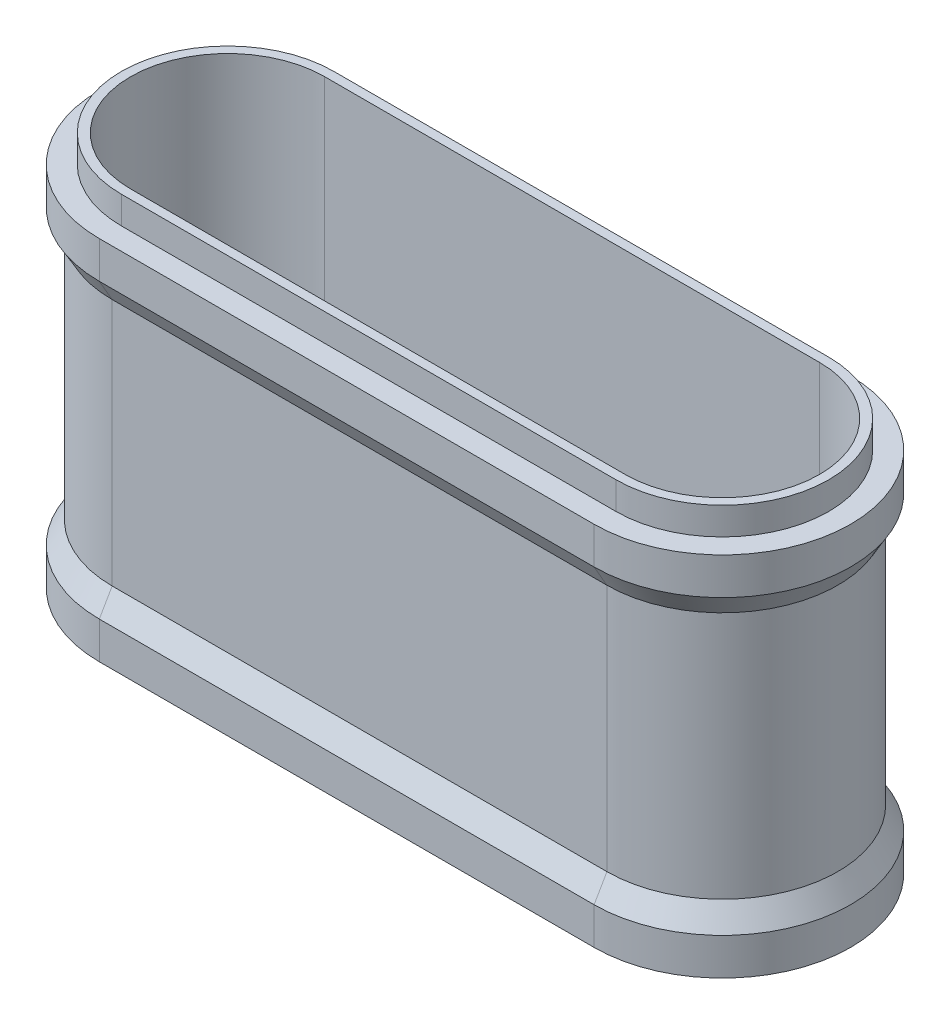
ISO-10303-21;
HEADER;
FILE_DESCRIPTION(('STEP AP214'),'2;1');
FILE_NAME('part.step','',(''),(''),'','','');
FILE_SCHEMA(('AUTOMOTIVE_DESIGN { 1 0 10303 214 1 1 1 1 }'));
ENDSEC;
DATA;
#1=APPLICATION_CONTEXT('core data for automotive mechanical design processes');
#2=APPLICATION_PROTOCOL_DEFINITION('international standard','automotive_design',2000,#1);
#3=PRODUCT_CONTEXT('',#1,'mechanical');
#4=PRODUCT('Part','Part','',(#3));
#5=PRODUCT_RELATED_PRODUCT_CATEGORY('part','',(#4));
#6=PRODUCT_DEFINITION_FORMATION('','',#4);
#7=PRODUCT_DEFINITION_CONTEXT('part definition',#1,'design');
#8=PRODUCT_DEFINITION('design','',#6,#7);
#9=PRODUCT_DEFINITION_SHAPE('','',#8);
#10=(LENGTH_UNIT() NAMED_UNIT(*) SI_UNIT(.MILLI.,.METRE.));
#11=(NAMED_UNIT(*) PLANE_ANGLE_UNIT() SI_UNIT($,.RADIAN.));
#12=(NAMED_UNIT(*) SI_UNIT($,.STERADIAN.) SOLID_ANGLE_UNIT());
#13=UNCERTAINTY_MEASURE_WITH_UNIT(LENGTH_MEASURE(1.E-05),#10,'distance_accuracy_value','');
#14=(GEOMETRIC_REPRESENTATION_CONTEXT(3) GLOBAL_UNCERTAINTY_ASSIGNED_CONTEXT((#13)) GLOBAL_UNIT_ASSIGNED_CONTEXT((#10,
#11,#12)) REPRESENTATION_CONTEXT('',''));
#15=CARTESIAN_POINT('',(0.,0.,0.));
#16=DIRECTION('',(0.,0.,1.));
#17=DIRECTION('',(1.,0.,0.));
#18=AXIS2_PLACEMENT_3D('',#15,#16,#17);
#19=CARTESIAN_POINT('',(-13.5,10.,0.));
#20=DIRECTION('',(0.,1.,0.));
#21=DIRECTION('',(0.,0.,1.));
#22=AXIS2_PLACEMENT_3D('',#19,#20,#21);
#23=PLANE('',#22);
#24=CARTESIAN_POINT('',(13.5,10.,0.));
#25=DIRECTION('',(0.,1.,0.));
#26=DIRECTION('',(0.,0.,1.));
#27=AXIS2_PLACEMENT_3D('',#24,#25,#26);
#28=CIRCLE('',#27,7.);
#29=CARTESIAN_POINT('',(13.5,10.,6.99999999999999));
#30=VERTEX_POINT('',#29);
#31=CARTESIAN_POINT('',(13.5,10.,-7.00000000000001));
#32=VERTEX_POINT('',#31);
#33=EDGE_CURVE('E279',#30,#32,#28,.T.);
#34=ORIENTED_EDGE('',*,*,#33,.T.);
#35=DIRECTION('',(-1.,0.,0.));
#36=VECTOR('',#35,1.);
#37=CARTESIAN_POINT('',(13.5,10.,-7.00000000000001));
#38=LINE('',#37,#36);
#39=CARTESIAN_POINT('',(-13.5,10.,-7.));
#40=VERTEX_POINT('',#39);
#41=EDGE_CURVE('E294',#32,#40,#38,.T.);
#42=ORIENTED_EDGE('',*,*,#41,.T.);
#43=CARTESIAN_POINT('',(-13.5,10.,0.));
#44=DIRECTION('',(0.,1.,0.));
#45=DIRECTION('',(0.,0.,1.));
#46=AXIS2_PLACEMENT_3D('',#43,#44,#45);
#47=CIRCLE('',#46,7.);
#48=CARTESIAN_POINT('',(-13.5,10.,7.));
#49=VERTEX_POINT('',#48);
#50=EDGE_CURVE('E298',#40,#49,#47,.T.);
#51=ORIENTED_EDGE('',*,*,#50,.T.);
#52=DIRECTION('',(1.,0.,0.));
#53=VECTOR('',#52,1.);
#54=CARTESIAN_POINT('',(13.5,10.,6.99999999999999));
#55=LINE('',#54,#53);
#56=EDGE_CURVE('E302',#49,#30,#55,.T.);
#57=ORIENTED_EDGE('',*,*,#56,.T.);
#58=EDGE_LOOP('',(#34,#42,#51,#57));
#59=FACE_BOUND('',#58,.T.);
#60=DIRECTION('',(1.,0.,0.));
#61=VECTOR('',#60,1.);
#62=CARTESIAN_POINT('',(-13.5,10.,5.8));
#63=LINE('',#62,#61);
#64=CARTESIAN_POINT('',(-13.5,10.,5.8));
#65=VERTEX_POINT('',#64);
#66=CARTESIAN_POINT('',(13.5,10.,5.8));
#67=VERTEX_POINT('',#66);
#68=EDGE_CURVE('E239',#65,#67,#63,.T.);
#69=ORIENTED_EDGE('',*,*,#68,.F.);
#70=CARTESIAN_POINT('',(-13.5,10.,0.));
#71=DIRECTION('',(0.,1.,0.));
#72=DIRECTION('',(0.,0.,1.));
#73=AXIS2_PLACEMENT_3D('',#70,#71,#72);
#74=CIRCLE('',#73,5.8);
#75=CARTESIAN_POINT('',(-13.5,10.,-5.8));
#76=VERTEX_POINT('',#75);
#77=EDGE_CURVE('E220',#76,#65,#74,.T.);
#78=ORIENTED_EDGE('',*,*,#77,.F.);
#79=DIRECTION('',(-1.,0.,0.));
#80=VECTOR('',#79,1.);
#81=CARTESIAN_POINT('',(13.5,10.,-5.8));
#82=LINE('',#81,#80);
#83=CARTESIAN_POINT('',(13.5,10.,-5.8));
#84=VERTEX_POINT('',#83);
#85=EDGE_CURVE('E226',#84,#76,#82,.T.);
#86=ORIENTED_EDGE('',*,*,#85,.F.);
#87=CARTESIAN_POINT('',(13.5,10.,0.));
#88=DIRECTION('',(0.,1.,0.));
#89=DIRECTION('',(0.,0.,1.));
#90=AXIS2_PLACEMENT_3D('',#87,#88,#89);
#91=CIRCLE('',#90,5.8);
#92=EDGE_CURVE('E242',#67,#84,#91,.T.);
#93=ORIENTED_EDGE('',*,*,#92,.F.);
#94=EDGE_LOOP('',(#69,#78,#86,#93));
#95=FACE_BOUND('',#94,.T.);
#96=ADVANCED_FACE('F44',(#59,#95),#23,.T.);
#97=CARTESIAN_POINT('',(-13.5,-10.,0.));
#98=DIRECTION('',(0.,1.,0.));
#99=DIRECTION('',(0.,0.,1.));
#100=AXIS2_PLACEMENT_3D('',#97,#98,#99);
#101=CYLINDRICAL_SURFACE('',#100,6.3);
#102=DIRECTION('',(0.,1.,0.));
#103=VECTOR('',#102,1.);
#104=CARTESIAN_POINT('',(-13.5,-10.,-6.3));
#105=LINE('',#104,#103);
#106=CARTESIAN_POINT('',(-13.5,-6.76794919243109,-6.3));
#107=VERTEX_POINT('',#106);
#108=CARTESIAN_POINT('',(-13.5,6.76794919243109,-6.3));
#109=VERTEX_POINT('',#108);
#110=EDGE_CURVE('E337',#107,#109,#105,.T.);
#111=ORIENTED_EDGE('',*,*,#110,.F.);
#112=CARTESIAN_POINT('',(-13.5,-6.76794919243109,0.));
#113=DIRECTION('',(0.,-1.,0.));
#114=DIRECTION('',(0.,0.,-1.));
#115=AXIS2_PLACEMENT_3D('',#112,#113,#114);
#116=CIRCLE('',#115,6.3);
#117=CARTESIAN_POINT('',(-13.5,-6.76794919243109,6.3));
#118=VERTEX_POINT('',#117);
#119=EDGE_CURVE('E375',#107,#118,#116,.F.);
#120=ORIENTED_EDGE('',*,*,#119,.T.);
#121=DIRECTION('',(0.,1.,0.));
#122=VECTOR('',#121,1.);
#123=CARTESIAN_POINT('',(-13.5,-10.,6.3));
#124=LINE('',#123,#122);
#125=CARTESIAN_POINT('',(-13.5,6.76794919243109,6.3));
#126=VERTEX_POINT('',#125);
#127=EDGE_CURVE('E331',#118,#126,#124,.T.);
#128=ORIENTED_EDGE('',*,*,#127,.T.);
#129=CARTESIAN_POINT('',(-13.5,6.76794919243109,0.));
#130=DIRECTION('',(0.,1.,0.));
#131=DIRECTION('',(0.,0.,1.));
#132=AXIS2_PLACEMENT_3D('',#129,#130,#131);
#133=CIRCLE('',#132,6.3);
#134=EDGE_CURVE('E372',#126,#109,#133,.F.);
#135=ORIENTED_EDGE('',*,*,#134,.T.);
#136=EDGE_LOOP('',(#111,#120,#128,#135));
#137=FACE_BOUND('',#136,.T.);
#138=ADVANCED_FACE('F476',(#137),#101,.T.);
#139=CARTESIAN_POINT('',(-13.5,-10.,-6.3));
#140=DIRECTION('',(0.,0.,-1.));
#141=DIRECTION('',(-1.,0.,0.));
#142=AXIS2_PLACEMENT_3D('',#139,#140,#141);
#143=PLANE('',#142);
#144=DIRECTION('',(0.,1.,0.));
#145=VECTOR('',#144,1.);
#146=CARTESIAN_POINT('',(13.5,-10.,-6.3));
#147=LINE('',#146,#145);
#148=CARTESIAN_POINT('',(13.5,-6.76794919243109,-6.3));
#149=VERTEX_POINT('',#148);
#150=CARTESIAN_POINT('',(13.5,6.76794919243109,-6.3));
#151=VERTEX_POINT('',#150);
#152=EDGE_CURVE('E342',#149,#151,#147,.T.);
#153=ORIENTED_EDGE('',*,*,#152,.F.);
#154=DIRECTION('',(-1.,0.,0.));
#155=VECTOR('',#154,1.);
#156=CARTESIAN_POINT('',(-13.5,-6.76794919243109,-6.3));
#157=LINE('',#156,#155);
#158=EDGE_CURVE('E363',#149,#107,#157,.T.);
#159=ORIENTED_EDGE('',*,*,#158,.T.);
#160=ORIENTED_EDGE('',*,*,#110,.T.);
#161=DIRECTION('',(1.,0.,0.));
#162=VECTOR('',#161,1.);
#163=CARTESIAN_POINT('',(-13.5,6.76794919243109,-6.3));
#164=LINE('',#163,#162);
#165=EDGE_CURVE('E359',#109,#151,#164,.T.);
#166=ORIENTED_EDGE('',*,*,#165,.T.);
#167=EDGE_LOOP('',(#153,#159,#160,#166));
#168=FACE_BOUND('',#167,.T.);
#169=ADVANCED_FACE('F457',(#168),#143,.T.);
#170=CARTESIAN_POINT('',(13.5,-10.,0.));
#171=DIRECTION('',(0.,1.,0.));
#172=DIRECTION('',(0.,0.,1.));
#173=AXIS2_PLACEMENT_3D('',#170,#171,#172);
#174=CYLINDRICAL_SURFACE('',#173,6.3);
#175=DIRECTION('',(0.,1.,0.));
#176=VECTOR('',#175,1.);
#177=CARTESIAN_POINT('',(13.5,-10.,6.3));
#178=LINE('',#177,#176);
#179=CARTESIAN_POINT('',(13.5,-6.76794919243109,6.3));
#180=VERTEX_POINT('',#179);
#181=CARTESIAN_POINT('',(13.5,6.76794919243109,6.3));
#182=VERTEX_POINT('',#181);
#183=EDGE_CURVE('E346',#180,#182,#178,.T.);
#184=ORIENTED_EDGE('',*,*,#183,.F.);
#185=CARTESIAN_POINT('',(13.5,-6.76794919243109,0.));
#186=DIRECTION('',(0.,-1.,0.));
#187=DIRECTION('',(0.,0.,-1.));
#188=AXIS2_PLACEMENT_3D('',#185,#186,#187);
#189=CIRCLE('',#188,6.3);
#190=EDGE_CURVE('E355',#180,#149,#189,.F.);
#191=ORIENTED_EDGE('',*,*,#190,.T.);
#192=ORIENTED_EDGE('',*,*,#152,.T.);
#193=CARTESIAN_POINT('',(13.5,6.76794919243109,0.));
#194=DIRECTION('',(0.,1.,0.));
#195=DIRECTION('',(0.,0.,1.));
#196=AXIS2_PLACEMENT_3D('',#193,#194,#195);
#197=CIRCLE('',#196,6.3);
#198=EDGE_CURVE('E341',#151,#182,#197,.F.);
#199=ORIENTED_EDGE('',*,*,#198,.T.);
#200=EDGE_LOOP('',(#184,#191,#192,#199));
#201=FACE_BOUND('',#200,.T.);
#202=ADVANCED_FACE('F461',(#201),#174,.T.);
#203=CARTESIAN_POINT('',(-13.5,-10.,6.3));
#204=DIRECTION('',(0.,0.,1.));
#205=DIRECTION('',(1.,0.,0.));
#206=AXIS2_PLACEMENT_3D('',#203,#204,#205);
#207=PLANE('',#206);
#208=ORIENTED_EDGE('',*,*,#127,.F.);
#209=DIRECTION('',(1.,0.,0.));
#210=VECTOR('',#209,1.);
#211=CARTESIAN_POINT('',(-13.5,-6.76794919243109,6.3));
#212=LINE('',#211,#210);
#213=EDGE_CURVE('E369',#118,#180,#212,.T.);
#214=ORIENTED_EDGE('',*,*,#213,.T.);
#215=ORIENTED_EDGE('',*,*,#183,.T.);
#216=DIRECTION('',(-1.,0.,0.));
#217=VECTOR('',#216,1.);
#218=CARTESIAN_POINT('',(-13.5,6.76794919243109,6.3));
#219=LINE('',#218,#217);
#220=EDGE_CURVE('E366',#182,#126,#219,.T.);
#221=ORIENTED_EDGE('',*,*,#220,.T.);
#222=EDGE_LOOP('',(#208,#214,#215,#221));
#223=FACE_BOUND('',#222,.T.);
#224=ADVANCED_FACE('F486',(#223),#207,.T.);
#225=CARTESIAN_POINT('',(-13.5,-10.,0.));
#226=DIRECTION('',(0.,1.,0.));
#227=DIRECTION('',(0.,0.,1.));
#228=AXIS2_PLACEMENT_3D('',#225,#226,#227);
#229=PLANE('',#228);
#230=DIRECTION('',(-1.,0.,0.));
#231=VECTOR('',#230,1.);
#232=CARTESIAN_POINT('',(-13.5,-10.,-5.3));
#233=LINE('',#232,#231);
#234=CARTESIAN_POINT('',(13.5,-10.,-5.30000000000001));
#235=VERTEX_POINT('',#234);
#236=CARTESIAN_POINT('',(-13.5,-10.,-5.3));
#237=VERTEX_POINT('',#236);
#238=EDGE_CURVE('E192',#235,#237,#233,.T.);
#239=ORIENTED_EDGE('',*,*,#238,.T.);
#240=CARTESIAN_POINT('',(-13.5,-10.,0.));
#241=DIRECTION('',(0.,1.,0.));
#242=DIRECTION('',(0.,0.,1.));
#243=AXIS2_PLACEMENT_3D('',#240,#241,#242);
#244=CIRCLE('',#243,5.3);
#245=CARTESIAN_POINT('',(-13.5,-10.,5.3));
#246=VERTEX_POINT('',#245);
#247=EDGE_CURVE('E309',#237,#246,#244,.T.);
#248=ORIENTED_EDGE('',*,*,#247,.T.);
#249=DIRECTION('',(1.,0.,0.));
#250=VECTOR('',#249,1.);
#251=CARTESIAN_POINT('',(-13.5,-10.,5.3));
#252=LINE('',#251,#250);
#253=CARTESIAN_POINT('',(13.5,-10.,5.29999999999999));
#254=VERTEX_POINT('',#253);
#255=EDGE_CURVE('E320',#246,#254,#252,.T.);
#256=ORIENTED_EDGE('',*,*,#255,.T.);
#257=CARTESIAN_POINT('',(13.5,-10.,0.));
#258=DIRECTION('',(0.,1.,0.));
#259=DIRECTION('',(0.,0.,1.));
#260=AXIS2_PLACEMENT_3D('',#257,#258,#259);
#261=CIRCLE('',#260,5.3);
#262=EDGE_CURVE('E324',#254,#235,#261,.T.);
#263=ORIENTED_EDGE('',*,*,#262,.T.);
#264=EDGE_LOOP('',(#239,#248,#256,#263));
#265=FACE_BOUND('',#264,.T.);
#266=CARTESIAN_POINT('',(13.5,-10.,0.));
#267=DIRECTION('',(0.,1.,0.));
#268=DIRECTION('',(0.,0.,1.));
#269=AXIS2_PLACEMENT_3D('',#266,#267,#268);
#270=CIRCLE('',#269,7.);
#271=CARTESIAN_POINT('',(13.5,-10.,6.99999999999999));
#272=VERTEX_POINT('',#271);
#273=CARTESIAN_POINT('',(13.5,-10.,-7.00000000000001));
#274=VERTEX_POINT('',#273);
#275=EDGE_CURVE('E261',#272,#274,#270,.T.);
#276=ORIENTED_EDGE('',*,*,#275,.F.);
#277=DIRECTION('',(1.,0.,0.));
#278=VECTOR('',#277,1.);
#279=CARTESIAN_POINT('',(13.5,-10.,6.99999999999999));
#280=LINE('',#279,#278);
#281=CARTESIAN_POINT('',(-13.5,-10.,7.));
#282=VERTEX_POINT('',#281);
#283=EDGE_CURVE('E265',#282,#272,#280,.T.);
#284=ORIENTED_EDGE('',*,*,#283,.F.);
#285=CARTESIAN_POINT('',(-13.5,-10.,0.));
#286=DIRECTION('',(0.,1.,0.));
#287=DIRECTION('',(0.,0.,1.));
#288=AXIS2_PLACEMENT_3D('',#285,#286,#287);
#289=CIRCLE('',#288,7.);
#290=CARTESIAN_POINT('',(-13.5,-10.,-7.));
#291=VERTEX_POINT('',#290);
#292=EDGE_CURVE('E268',#291,#282,#289,.T.);
#293=ORIENTED_EDGE('',*,*,#292,.F.);
#294=DIRECTION('',(-1.,0.,0.));
#295=VECTOR('',#294,1.);
#296=CARTESIAN_POINT('',(13.5,-10.,-7.00000000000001));
#297=LINE('',#296,#295);
#298=EDGE_CURVE('E271',#274,#291,#297,.T.);
#299=ORIENTED_EDGE('',*,*,#298,.F.);
#300=EDGE_LOOP('',(#276,#284,#293,#299));
#301=FACE_BOUND('',#300,.T.);
#302=ADVANCED_FACE('F488',(#265,#301),#229,.F.);
#303=CARTESIAN_POINT('',(-13.5,-10.,0.));
#304=DIRECTION('',(0.,1.,0.));
#305=DIRECTION('',(0.,0.,1.));
#306=AXIS2_PLACEMENT_3D('',#303,#304,#305);
#307=CYLINDRICAL_SURFACE('',#306,5.3);
#308=DIRECTION('',(0.,1.,0.));
#309=VECTOR('',#308,1.);
#310=CARTESIAN_POINT('',(-13.5,-10.,-5.3));
#311=LINE('',#310,#309);
#312=CARTESIAN_POINT('',(-13.5,11.5,-5.3));
#313=VERTEX_POINT('',#312);
#314=EDGE_CURVE('E196',#237,#313,#311,.T.);
#315=ORIENTED_EDGE('',*,*,#314,.T.);
#316=CARTESIAN_POINT('',(-13.5,11.5,0.));
#317=DIRECTION('',(0.,1.,0.));
#318=DIRECTION('',(0.,0.,1.));
#319=AXIS2_PLACEMENT_3D('',#316,#317,#318);
#320=CIRCLE('',#319,5.3);
#321=CARTESIAN_POINT('',(-13.5,11.5,5.3));
#322=VERTEX_POINT('',#321);
#323=EDGE_CURVE('E211',#313,#322,#320,.T.);
#324=ORIENTED_EDGE('',*,*,#323,.T.);
#325=DIRECTION('',(0.,1.,0.));
#326=VECTOR('',#325,1.);
#327=CARTESIAN_POINT('',(-13.5,-10.,5.3));
#328=LINE('',#327,#326);
#329=EDGE_CURVE('E329',#246,#322,#328,.T.);
#330=ORIENTED_EDGE('',*,*,#329,.F.);
#331=ORIENTED_EDGE('',*,*,#247,.F.);
#332=EDGE_LOOP('',(#315,#324,#330,#331));
#333=FACE_BOUND('',#332,.T.);
#334=ADVANCED_FACE('F494',(#333),#307,.F.);
#335=CARTESIAN_POINT('',(-13.5,-10.,-5.3));
#336=DIRECTION('',(0.,0.,-1.));
#337=DIRECTION('',(-1.,0.,0.));
#338=AXIS2_PLACEMENT_3D('',#335,#336,#337);
#339=PLANE('',#338);
#340=DIRECTION('',(0.,1.,0.));
#341=VECTOR('',#340,1.);
#342=CARTESIAN_POINT('',(13.5,-10.,-5.30000000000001));
#343=LINE('',#342,#341);
#344=CARTESIAN_POINT('',(13.5,11.5,-5.30000000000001));
#345=VERTEX_POINT('',#344);
#346=EDGE_CURVE('E185',#235,#345,#343,.T.);
#347=ORIENTED_EDGE('',*,*,#346,.T.);
#348=DIRECTION('',(-1.,0.,0.));
#349=VECTOR('',#348,1.);
#350=CARTESIAN_POINT('',(13.5,11.5,-5.30000000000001));
#351=LINE('',#350,#349);
#352=EDGE_CURVE('E189',#345,#313,#351,.T.);
#353=ORIENTED_EDGE('',*,*,#352,.T.);
#354=ORIENTED_EDGE('',*,*,#314,.F.);
#355=ORIENTED_EDGE('',*,*,#238,.F.);
#356=EDGE_LOOP('',(#347,#353,#354,#355));
#357=FACE_BOUND('',#356,.T.);
#358=ADVANCED_FACE('F187',(#357),#339,.F.);
#359=CARTESIAN_POINT('',(13.5,-10.,0.));
#360=DIRECTION('',(0.,1.,0.));
#361=DIRECTION('',(0.,0.,1.));
#362=AXIS2_PLACEMENT_3D('',#359,#360,#361);
#363=CYLINDRICAL_SURFACE('',#362,5.3);
#364=DIRECTION('',(0.,1.,0.));
#365=VECTOR('',#364,1.);
#366=CARTESIAN_POINT('',(13.5,-10.,5.3));
#367=LINE('',#366,#365);
#368=CARTESIAN_POINT('',(13.5,11.5,5.3));
#369=VERTEX_POINT('',#368);
#370=EDGE_CURVE('E197',#254,#369,#367,.T.);
#371=ORIENTED_EDGE('',*,*,#370,.T.);
#372=CARTESIAN_POINT('',(13.5,11.5,0.));
#373=DIRECTION('',(0.,1.,0.));
#374=DIRECTION('',(0.,0.,1.));
#375=AXIS2_PLACEMENT_3D('',#372,#373,#374);
#376=CIRCLE('',#375,5.3);
#377=EDGE_CURVE('E200',#369,#345,#376,.T.);
#378=ORIENTED_EDGE('',*,*,#377,.T.);
#379=ORIENTED_EDGE('',*,*,#346,.F.);
#380=ORIENTED_EDGE('',*,*,#262,.F.);
#381=EDGE_LOOP('',(#371,#378,#379,#380));
#382=FACE_BOUND('',#381,.T.);
#383=ADVANCED_FACE('F201',(#382),#363,.F.);
#384=CARTESIAN_POINT('',(-13.5,-10.,5.3));
#385=DIRECTION('',(0.,0.,1.));
#386=DIRECTION('',(1.,0.,0.));
#387=AXIS2_PLACEMENT_3D('',#384,#385,#386);
#388=PLANE('',#387);
#389=ORIENTED_EDGE('',*,*,#329,.T.);
#390=DIRECTION('',(1.,0.,0.));
#391=VECTOR('',#390,1.);
#392=CARTESIAN_POINT('',(-13.5,11.5,5.3));
#393=LINE('',#392,#391);
#394=EDGE_CURVE('E215',#322,#369,#393,.T.);
#395=ORIENTED_EDGE('',*,*,#394,.T.);
#396=ORIENTED_EDGE('',*,*,#370,.F.);
#397=ORIENTED_EDGE('',*,*,#255,.F.);
#398=EDGE_LOOP('',(#389,#395,#396,#397));
#399=FACE_BOUND('',#398,.T.);
#400=ADVANCED_FACE('F511',(#399),#388,.F.);
#401=CARTESIAN_POINT('',(13.5,8.5,0.));
#402=DIRECTION('',(0.,1.,0.));
#403=DIRECTION('',(0.,0.,1.));
#404=AXIS2_PLACEMENT_3D('',#401,#402,#403);
#405=CYLINDRICAL_SURFACE('',#404,7.);
#406=ORIENTED_EDGE('',*,*,#33,.F.);
#407=DIRECTION('',(0.,1.,0.));
#408=VECTOR('',#407,1.);
#409=CARTESIAN_POINT('',(13.5,8.5,6.99999999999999));
#410=LINE('',#409,#408);
#411=CARTESIAN_POINT('',(13.5,7.98038475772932,7.));
#412=VERTEX_POINT('',#411);
#413=EDGE_CURVE('E63',#412,#30,#410,.T.);
#414=ORIENTED_EDGE('',*,*,#413,.F.);
#415=CARTESIAN_POINT('',(13.5,7.98038475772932,0.));
#416=DIRECTION('',(0.,1.,0.));
#417=DIRECTION('',(0.,0.,1.));
#418=AXIS2_PLACEMENT_3D('',#415,#416,#417);
#419=CIRCLE('',#418,7.);
#420=CARTESIAN_POINT('',(13.5,7.98038475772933,-7.00000000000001));
#421=VERTEX_POINT('',#420);
#422=EDGE_CURVE('E398',#412,#421,#419,.T.);
#423=ORIENTED_EDGE('',*,*,#422,.T.);
#424=DIRECTION('',(0.,1.,0.));
#425=VECTOR('',#424,1.);
#426=CARTESIAN_POINT('',(13.5,8.5,-7.00000000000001));
#427=LINE('',#426,#425);
#428=EDGE_CURVE('E306',#421,#32,#427,.T.);
#429=ORIENTED_EDGE('',*,*,#428,.T.);
#430=EDGE_LOOP('',(#406,#414,#423,#429));
#431=FACE_BOUND('',#430,.T.);
#432=ADVANCED_FACE('F442',(#431),#405,.T.);
#433=CARTESIAN_POINT('',(13.5,8.5,6.99999999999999));
#434=DIRECTION('',(0.,0.,1.));
#435=DIRECTION('',(1.,0.,0.));
#436=AXIS2_PLACEMENT_3D('',#433,#434,#435);
#437=PLANE('',#436);
#438=ORIENTED_EDGE('',*,*,#56,.F.);
#439=DIRECTION('',(0.,1.,0.));
#440=VECTOR('',#439,1.);
#441=CARTESIAN_POINT('',(-13.5,8.5,7.));
#442=LINE('',#441,#440);
#443=CARTESIAN_POINT('',(-13.5,7.98038475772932,7.));
#444=VERTEX_POINT('',#443);
#445=EDGE_CURVE('E69',#444,#49,#442,.T.);
#446=ORIENTED_EDGE('',*,*,#445,.F.);
#447=DIRECTION('',(1.,0.,0.));
#448=VECTOR('',#447,1.);
#449=CARTESIAN_POINT('',(-13.5,7.98038475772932,7.));
#450=LINE('',#449,#448);
#451=EDGE_CURVE('E11',#444,#412,#450,.T.);
#452=ORIENTED_EDGE('',*,*,#451,.T.);
#453=ORIENTED_EDGE('',*,*,#413,.T.);
#454=EDGE_LOOP('',(#438,#446,#452,#453));
#455=FACE_BOUND('',#454,.T.);
#456=ADVANCED_FACE('F441',(#455),#437,.T.);
#457=CARTESIAN_POINT('',(-13.5,8.5,0.));
#458=DIRECTION('',(0.,1.,0.));
#459=DIRECTION('',(0.,0.,1.));
#460=AXIS2_PLACEMENT_3D('',#457,#458,#459);
#461=CYLINDRICAL_SURFACE('',#460,7.);
#462=ORIENTED_EDGE('',*,*,#50,.F.);
#463=DIRECTION('',(0.,1.,0.));
#464=VECTOR('',#463,1.);
#465=CARTESIAN_POINT('',(-13.5,8.5,-7.));
#466=LINE('',#465,#464);
#467=CARTESIAN_POINT('',(-13.5,7.98038475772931,-7.));
#468=VERTEX_POINT('',#467);
#469=EDGE_CURVE('E312',#468,#40,#466,.T.);
#470=ORIENTED_EDGE('',*,*,#469,.F.);
#471=CARTESIAN_POINT('',(-13.5,7.98038475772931,0.));
#472=DIRECTION('',(0.,1.,0.));
#473=DIRECTION('',(0.,0.,1.));
#474=AXIS2_PLACEMENT_3D('',#471,#472,#473);
#475=CIRCLE('',#474,7.);
#476=EDGE_CURVE('E55',#468,#444,#475,.T.);
#477=ORIENTED_EDGE('',*,*,#476,.T.);
#478=ORIENTED_EDGE('',*,*,#445,.T.);
#479=EDGE_LOOP('',(#462,#470,#477,#478));
#480=FACE_BOUND('',#479,.T.);
#481=ADVANCED_FACE('F448',(#480),#461,.T.);
#482=CARTESIAN_POINT('',(13.5,8.5,-7.00000000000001));
#483=DIRECTION('',(0.,0.,-1.));
#484=DIRECTION('',(-1.,0.,0.));
#485=AXIS2_PLACEMENT_3D('',#482,#483,#484);
#486=PLANE('',#485);
#487=ORIENTED_EDGE('',*,*,#428,.F.);
#488=DIRECTION('',(-1.,0.,0.));
#489=VECTOR('',#488,1.);
#490=CARTESIAN_POINT('',(-13.5,7.98038475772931,-7.));
#491=LINE('',#490,#489);
#492=EDGE_CURVE('E394',#421,#468,#491,.T.);
#493=ORIENTED_EDGE('',*,*,#492,.T.);
#494=ORIENTED_EDGE('',*,*,#469,.T.);
#495=ORIENTED_EDGE('',*,*,#41,.F.);
#496=EDGE_LOOP('',(#487,#493,#494,#495));
#497=FACE_BOUND('',#496,.T.);
#498=ADVANCED_FACE('F561',(#497),#486,.T.);
#499=CARTESIAN_POINT('',(13.5,-8.5,0.));
#500=DIRECTION('',(0.,-1.,0.));
#501=DIRECTION('',(0.,0.,-1.));
#502=AXIS2_PLACEMENT_3D('',#499,#500,#501);
#503=CYLINDRICAL_SURFACE('',#502,7.);
#504=ORIENTED_EDGE('',*,*,#275,.T.);
#505=DIRECTION('',(0.,-1.,0.));
#506=VECTOR('',#505,1.);
#507=CARTESIAN_POINT('',(13.5,-8.5,-7.00000000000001));
#508=LINE('',#507,#506);
#509=CARTESIAN_POINT('',(13.5,-7.98038475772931,-7.));
#510=VERTEX_POINT('',#509);
#511=EDGE_CURVE('E275',#510,#274,#508,.T.);
#512=ORIENTED_EDGE('',*,*,#511,.F.);
#513=CARTESIAN_POINT('',(13.5,-7.98038475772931,0.));
#514=DIRECTION('',(0.,-1.,0.));
#515=DIRECTION('',(0.,0.,-1.));
#516=AXIS2_PLACEMENT_3D('',#513,#514,#515);
#517=CIRCLE('',#516,7.);
#518=CARTESIAN_POINT('',(13.5,-7.98038475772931,6.99999999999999));
#519=VERTEX_POINT('',#518);
#520=EDGE_CURVE('E378',#510,#519,#517,.T.);
#521=ORIENTED_EDGE('',*,*,#520,.T.);
#522=DIRECTION('',(0.,-1.,0.));
#523=VECTOR('',#522,1.);
#524=CARTESIAN_POINT('',(13.5,-8.5,6.99999999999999));
#525=LINE('',#524,#523);
#526=EDGE_CURVE('E274',#519,#272,#525,.T.);
#527=ORIENTED_EDGE('',*,*,#526,.T.);
#528=EDGE_LOOP('',(#504,#512,#521,#527));
#529=FACE_BOUND('',#528,.T.);
#530=ADVANCED_FACE('F570',(#529),#503,.T.);
#531=CARTESIAN_POINT('',(13.5,-8.5,-7.00000000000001));
#532=DIRECTION('',(0.,0.,1.));
#533=DIRECTION('',(1.,0.,0.));
#534=AXIS2_PLACEMENT_3D('',#531,#532,#533);
#535=PLANE('',#534);
#536=ORIENTED_EDGE('',*,*,#298,.T.);
#537=DIRECTION('',(0.,-1.,0.));
#538=VECTOR('',#537,1.);
#539=CARTESIAN_POINT('',(-13.5,-8.5,-7.));
#540=LINE('',#539,#538);
#541=CARTESIAN_POINT('',(-13.5,-7.98038475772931,-7.));
#542=VERTEX_POINT('',#541);
#543=EDGE_CURVE('E280',#542,#291,#540,.T.);
#544=ORIENTED_EDGE('',*,*,#543,.F.);
#545=DIRECTION('',(1.,0.,0.));
#546=VECTOR('',#545,1.);
#547=CARTESIAN_POINT('',(13.5,-7.98038475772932,-7.00000000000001));
#548=LINE('',#547,#546);
#549=EDGE_CURVE('E382',#542,#510,#548,.T.);
#550=ORIENTED_EDGE('',*,*,#549,.T.);
#551=ORIENTED_EDGE('',*,*,#511,.T.);
#552=EDGE_LOOP('',(#536,#544,#550,#551));
#553=FACE_BOUND('',#552,.T.);
#554=ADVANCED_FACE('F579',(#553),#535,.F.);
#555=CARTESIAN_POINT('',(-13.5,-8.5,0.));
#556=DIRECTION('',(0.,-1.,0.));
#557=DIRECTION('',(0.,0.,-1.));
#558=AXIS2_PLACEMENT_3D('',#555,#556,#557);
#559=CYLINDRICAL_SURFACE('',#558,7.);
#560=ORIENTED_EDGE('',*,*,#292,.T.);
#561=DIRECTION('',(0.,-1.,0.));
#562=VECTOR('',#561,1.);
#563=CARTESIAN_POINT('',(-13.5,-8.5,7.));
#564=LINE('',#563,#562);
#565=CARTESIAN_POINT('',(-13.5,-7.98038475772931,7.));
#566=VERTEX_POINT('',#565);
#567=EDGE_CURVE('E284',#566,#282,#564,.T.);
#568=ORIENTED_EDGE('',*,*,#567,.F.);
#569=CARTESIAN_POINT('',(-13.5,-7.98038475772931,0.));
#570=DIRECTION('',(0.,-1.,0.));
#571=DIRECTION('',(0.,0.,-1.));
#572=AXIS2_PLACEMENT_3D('',#569,#570,#571);
#573=CIRCLE('',#572,7.);
#574=EDGE_CURVE('E390',#566,#542,#573,.T.);
#575=ORIENTED_EDGE('',*,*,#574,.T.);
#576=ORIENTED_EDGE('',*,*,#543,.T.);
#577=EDGE_LOOP('',(#560,#568,#575,#576));
#578=FACE_BOUND('',#577,.T.);
#579=ADVANCED_FACE('F591',(#578),#559,.T.);
#580=CARTESIAN_POINT('',(13.5,-8.5,6.99999999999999));
#581=DIRECTION('',(0.,0.,-1.));
#582=DIRECTION('',(-1.,0.,0.));
#583=AXIS2_PLACEMENT_3D('',#580,#581,#582);
#584=PLANE('',#583);
#585=ORIENTED_EDGE('',*,*,#283,.T.);
#586=ORIENTED_EDGE('',*,*,#526,.F.);
#587=DIRECTION('',(-1.,0.,0.));
#588=VECTOR('',#587,1.);
#589=CARTESIAN_POINT('',(13.5,-7.98038475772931,6.99999999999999));
#590=LINE('',#589,#588);
#591=EDGE_CURVE('E386',#519,#566,#590,.T.);
#592=ORIENTED_EDGE('',*,*,#591,.T.);
#593=ORIENTED_EDGE('',*,*,#567,.T.);
#594=EDGE_LOOP('',(#585,#586,#592,#593));
#595=FACE_BOUND('',#594,.T.);
#596=ADVANCED_FACE('F602',(#595),#584,.F.);
#597=CARTESIAN_POINT('',(-13.5,11.5,0.));
#598=DIRECTION('',(0.,1.,0.));
#599=DIRECTION('',(0.,0.,1.));
#600=AXIS2_PLACEMENT_3D('',#597,#598,#599);
#601=PLANE('',#600);
#602=CARTESIAN_POINT('',(-13.5,11.5,0.));
#603=DIRECTION('',(0.,1.,0.));
#604=DIRECTION('',(0.,0.,1.));
#605=AXIS2_PLACEMENT_3D('',#602,#603,#604);
#606=CIRCLE('',#605,5.8);
#607=CARTESIAN_POINT('',(-13.5,11.5,-5.8));
#608=VERTEX_POINT('',#607);
#609=CARTESIAN_POINT('',(-13.5,11.5,5.8));
#610=VERTEX_POINT('',#609);
#611=EDGE_CURVE('E221',#608,#610,#606,.T.);
#612=ORIENTED_EDGE('',*,*,#611,.T.);
#613=DIRECTION('',(1.,0.,0.));
#614=VECTOR('',#613,1.);
#615=CARTESIAN_POINT('',(-13.5,11.5,5.8));
#616=LINE('',#615,#614);
#617=CARTESIAN_POINT('',(13.5,11.5,5.8));
#618=VERTEX_POINT('',#617);
#619=EDGE_CURVE('E225',#610,#618,#616,.T.);
#620=ORIENTED_EDGE('',*,*,#619,.T.);
#621=CARTESIAN_POINT('',(13.5,11.5,0.));
#622=DIRECTION('',(0.,1.,0.));
#623=DIRECTION('',(0.,0.,1.));
#624=AXIS2_PLACEMENT_3D('',#621,#622,#623);
#625=CIRCLE('',#624,5.8);
#626=CARTESIAN_POINT('',(13.5,11.5,-5.8));
#627=VERTEX_POINT('',#626);
#628=EDGE_CURVE('E229',#618,#627,#625,.T.);
#629=ORIENTED_EDGE('',*,*,#628,.T.);
#630=DIRECTION('',(-1.,0.,0.));
#631=VECTOR('',#630,1.);
#632=CARTESIAN_POINT('',(13.5,11.5,-5.8));
#633=LINE('',#632,#631);
#634=EDGE_CURVE('E232',#627,#608,#633,.T.);
#635=ORIENTED_EDGE('',*,*,#634,.T.);
#636=EDGE_LOOP('',(#612,#620,#629,#635));
#637=FACE_BOUND('',#636,.T.);
#638=ORIENTED_EDGE('',*,*,#352,.F.);
#639=ORIENTED_EDGE('',*,*,#377,.F.);
#640=ORIENTED_EDGE('',*,*,#394,.F.);
#641=ORIENTED_EDGE('',*,*,#323,.F.);
#642=EDGE_LOOP('',(#638,#639,#640,#641));
#643=FACE_BOUND('',#642,.T.);
#644=ADVANCED_FACE('F209',(#637,#643),#601,.T.);
#645=CARTESIAN_POINT('',(-13.5,11.5,0.));
#646=DIRECTION('',(0.,-1.,0.));
#647=DIRECTION('',(0.,0.,-1.));
#648=AXIS2_PLACEMENT_3D('',#645,#646,#647);
#649=CYLINDRICAL_SURFACE('',#648,5.8);
#650=ORIENTED_EDGE('',*,*,#77,.T.);
#651=DIRECTION('',(0.,-1.,0.));
#652=VECTOR('',#651,1.);
#653=CARTESIAN_POINT('',(-13.5,11.5,5.8));
#654=LINE('',#653,#652);
#655=EDGE_CURVE('E258',#610,#65,#654,.T.);
#656=ORIENTED_EDGE('',*,*,#655,.F.);
#657=ORIENTED_EDGE('',*,*,#611,.F.);
#658=DIRECTION('',(0.,-1.,0.));
#659=VECTOR('',#658,1.);
#660=CARTESIAN_POINT('',(-13.5,11.5,-5.8));
#661=LINE('',#660,#659);
#662=EDGE_CURVE('E235',#608,#76,#661,.T.);
#663=ORIENTED_EDGE('',*,*,#662,.T.);
#664=EDGE_LOOP('',(#650,#656,#657,#663));
#665=FACE_BOUND('',#664,.T.);
#666=ADVANCED_FACE('F725',(#665),#649,.T.);
#667=CARTESIAN_POINT('',(-13.5,11.5,5.8));
#668=DIRECTION('',(0.,0.,-1.));
#669=DIRECTION('',(-1.,0.,0.));
#670=AXIS2_PLACEMENT_3D('',#667,#668,#669);
#671=PLANE('',#670);
#672=ORIENTED_EDGE('',*,*,#68,.T.);
#673=DIRECTION('',(0.,-1.,0.));
#674=VECTOR('',#673,1.);
#675=CARTESIAN_POINT('',(13.5,11.5,5.8));
#676=LINE('',#675,#674);
#677=EDGE_CURVE('E254',#618,#67,#676,.T.);
#678=ORIENTED_EDGE('',*,*,#677,.F.);
#679=ORIENTED_EDGE('',*,*,#619,.F.);
#680=ORIENTED_EDGE('',*,*,#655,.T.);
#681=EDGE_LOOP('',(#672,#678,#679,#680));
#682=FACE_BOUND('',#681,.T.);
#683=ADVANCED_FACE('F715',(#682),#671,.F.);
#684=CARTESIAN_POINT('',(13.5,11.5,0.));
#685=DIRECTION('',(0.,-1.,0.));
#686=DIRECTION('',(0.,0.,-1.));
#687=AXIS2_PLACEMENT_3D('',#684,#685,#686);
#688=CYLINDRICAL_SURFACE('',#687,5.8);
#689=ORIENTED_EDGE('',*,*,#92,.T.);
#690=DIRECTION('',(0.,-1.,0.));
#691=VECTOR('',#690,1.);
#692=CARTESIAN_POINT('',(13.5,11.5,-5.8));
#693=LINE('',#692,#691);
#694=EDGE_CURVE('E251',#627,#84,#693,.T.);
#695=ORIENTED_EDGE('',*,*,#694,.F.);
#696=ORIENTED_EDGE('',*,*,#628,.F.);
#697=ORIENTED_EDGE('',*,*,#677,.T.);
#698=EDGE_LOOP('',(#689,#695,#696,#697));
#699=FACE_BOUND('',#698,.T.);
#700=ADVANCED_FACE('F705',(#699),#688,.T.);
#701=CARTESIAN_POINT('',(13.5,11.5,-5.8));
#702=DIRECTION('',(0.,0.,1.));
#703=DIRECTION('',(1.,0.,0.));
#704=AXIS2_PLACEMENT_3D('',#701,#702,#703);
#705=PLANE('',#704);
#706=ORIENTED_EDGE('',*,*,#85,.T.);
#707=ORIENTED_EDGE('',*,*,#662,.F.);
#708=ORIENTED_EDGE('',*,*,#634,.F.);
#709=ORIENTED_EDGE('',*,*,#694,.T.);
#710=EDGE_LOOP('',(#706,#707,#708,#709));
#711=FACE_BOUND('',#710,.T.);
#712=ADVANCED_FACE('F625',(#711),#705,.F.);
#713=CARTESIAN_POINT('',(-13.5,-6.76794919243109,0.));
#714=DIRECTION('',(0.,-1.,0.));
#715=DIRECTION('',(0.,0.,-1.));
#716=AXIS2_PLACEMENT_3D('',#713,#714,#715);
#717=CONICAL_SURFACE('',#716,6.3,0.523598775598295);
#718=DIRECTION('',(0.,0.866025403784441,0.499999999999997));
#719=VECTOR('',#718,1.);
#720=CARTESIAN_POINT('',(-13.5,-8.5,-7.30000000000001));
#721=LINE('',#720,#719);
#722=EDGE_CURVE('E410',#542,#107,#721,.T.);
#723=ORIENTED_EDGE('',*,*,#722,.F.);
#724=ORIENTED_EDGE('',*,*,#574,.F.);
#725=DIRECTION('',(0.,-0.866025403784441,0.499999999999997));
#726=VECTOR('',#725,1.);
#727=CARTESIAN_POINT('',(-13.5,-6.76794919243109,6.3));
#728=LINE('',#727,#726);
#729=EDGE_CURVE('E207',#118,#566,#728,.T.);
#730=ORIENTED_EDGE('',*,*,#729,.F.);
#731=ORIENTED_EDGE('',*,*,#119,.F.);
#732=EDGE_LOOP('',(#723,#724,#730,#731));
#733=FACE_BOUND('',#732,.T.);
#734=ADVANCED_FACE('F480',(#733),#717,.T.);
#735=CARTESIAN_POINT('',(-13.5,-6.76794919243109,6.3));
#736=DIRECTION('',(0.,-0.499999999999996,-0.866025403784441));
#737=DIRECTION('',(1.,0.,0.));
#738=AXIS2_PLACEMENT_3D('',#735,#736,#737);
#739=PLANE('',#738);
#740=ORIENTED_EDGE('',*,*,#729,.T.);
#741=ORIENTED_EDGE('',*,*,#591,.F.);
#742=DIRECTION('',(0.,-0.866025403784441,0.499999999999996));
#743=VECTOR('',#742,1.);
#744=CARTESIAN_POINT('',(13.5,-6.76794919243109,6.29999999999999));
#745=LINE('',#744,#743);
#746=EDGE_CURVE('E406',#180,#519,#745,.T.);
#747=ORIENTED_EDGE('',*,*,#746,.F.);
#748=ORIENTED_EDGE('',*,*,#213,.F.);
#749=EDGE_LOOP('',(#740,#741,#747,#748));
#750=FACE_BOUND('',#749,.T.);
#751=ADVANCED_FACE('F484',(#750),#739,.F.);
#752=CARTESIAN_POINT('',(-13.5,-6.76794919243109,-6.3));
#753=DIRECTION('',(0.,-0.499999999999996,0.866025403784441));
#754=DIRECTION('',(-1.,0.,0.));
#755=AXIS2_PLACEMENT_3D('',#752,#753,#754);
#756=PLANE('',#755);
#757=ORIENTED_EDGE('',*,*,#722,.T.);
#758=ORIENTED_EDGE('',*,*,#158,.F.);
#759=DIRECTION('',(0.,0.866025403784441,0.499999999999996));
#760=VECTOR('',#759,1.);
#761=CARTESIAN_POINT('',(13.5,-8.5,-7.30000000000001));
#762=LINE('',#761,#760);
#763=EDGE_CURVE('E403',#510,#149,#762,.T.);
#764=ORIENTED_EDGE('',*,*,#763,.F.);
#765=ORIENTED_EDGE('',*,*,#549,.F.);
#766=EDGE_LOOP('',(#757,#758,#764,#765));
#767=FACE_BOUND('',#766,.T.);
#768=ADVANCED_FACE('F472',(#767),#756,.F.);
#769=CARTESIAN_POINT('',(13.5,-6.76794919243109,0.));
#770=DIRECTION('',(0.,-1.,0.));
#771=DIRECTION('',(0.,0.,-1.));
#772=AXIS2_PLACEMENT_3D('',#769,#770,#771);
#773=CONICAL_SURFACE('',#772,6.3,0.523598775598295);
#774=ORIENTED_EDGE('',*,*,#746,.T.);
#775=ORIENTED_EDGE('',*,*,#520,.F.);
#776=ORIENTED_EDGE('',*,*,#763,.T.);
#777=ORIENTED_EDGE('',*,*,#190,.F.);
#778=EDGE_LOOP('',(#774,#775,#776,#777));
#779=FACE_BOUND('',#778,.T.);
#780=ADVANCED_FACE('F465',(#779),#773,.T.);
#781=CARTESIAN_POINT('',(-13.5,6.76794919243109,6.3));
#782=DIRECTION('',(0.,0.499999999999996,-0.866025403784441));
#783=DIRECTION('',(-1.,0.,0.));
#784=AXIS2_PLACEMENT_3D('',#781,#782,#783);
#785=PLANE('',#784);
#786=DIRECTION('',(0.,-0.866025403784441,-0.499999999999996));
#787=VECTOR('',#786,1.);
#788=CARTESIAN_POINT('',(13.5,8.5,7.30000000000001));
#789=LINE('',#788,#787);
#790=EDGE_CURVE('E423',#412,#182,#789,.T.);
#791=ORIENTED_EDGE('',*,*,#790,.F.);
#792=ORIENTED_EDGE('',*,*,#451,.F.);
#793=DIRECTION('',(0.,0.866025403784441,0.499999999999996));
#794=VECTOR('',#793,1.);
#795=CARTESIAN_POINT('',(-13.5,6.76794919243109,6.3));
#796=LINE('',#795,#794);
#797=EDGE_CURVE('E49',#126,#444,#796,.T.);
#798=ORIENTED_EDGE('',*,*,#797,.F.);
#799=ORIENTED_EDGE('',*,*,#220,.F.);
#800=EDGE_LOOP('',(#791,#792,#798,#799));
#801=FACE_BOUND('',#800,.T.);
#802=ADVANCED_FACE('F47',(#801),#785,.F.);
#803=CARTESIAN_POINT('',(-13.5,6.76794919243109,0.));
#804=DIRECTION('',(0.,1.,0.));
#805=DIRECTION('',(0.,0.,1.));
#806=AXIS2_PLACEMENT_3D('',#803,#804,#805);
#807=CONICAL_SURFACE('',#806,6.3,0.523598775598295);
#808=ORIENTED_EDGE('',*,*,#797,.T.);
#809=ORIENTED_EDGE('',*,*,#476,.F.);
#810=DIRECTION('',(0.,0.866025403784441,-0.499999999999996));
#811=VECTOR('',#810,1.);
#812=CARTESIAN_POINT('',(-13.5,6.76794919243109,-6.3));
#813=LINE('',#812,#811);
#814=EDGE_CURVE('E420',#109,#468,#813,.T.);
#815=ORIENTED_EDGE('',*,*,#814,.F.);
#816=ORIENTED_EDGE('',*,*,#134,.F.);
#817=EDGE_LOOP('',(#808,#809,#815,#816));
#818=FACE_BOUND('',#817,.T.);
#819=ADVANCED_FACE('F436',(#818),#807,.T.);
#820=CARTESIAN_POINT('',(13.5,6.76794919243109,0.));
#821=DIRECTION('',(0.,1.,0.));
#822=DIRECTION('',(0.,0.,1.));
#823=AXIS2_PLACEMENT_3D('',#820,#821,#822);
#824=CONICAL_SURFACE('',#823,6.3,0.523598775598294);
#825=ORIENTED_EDGE('',*,*,#790,.T.);
#826=ORIENTED_EDGE('',*,*,#198,.F.);
#827=DIRECTION('',(0.,-0.866025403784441,0.499999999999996));
#828=VECTOR('',#827,1.);
#829=CARTESIAN_POINT('',(13.5,8.5,-7.30000000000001));
#830=LINE('',#829,#828);
#831=EDGE_CURVE('E417',#421,#151,#830,.T.);
#832=ORIENTED_EDGE('',*,*,#831,.F.);
#833=ORIENTED_EDGE('',*,*,#422,.F.);
#834=EDGE_LOOP('',(#825,#826,#832,#833));
#835=FACE_BOUND('',#834,.T.);
#836=ADVANCED_FACE('F672',(#835),#824,.T.);
#837=CARTESIAN_POINT('',(-13.5,6.76794919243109,-6.3));
#838=DIRECTION('',(0.,0.499999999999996,0.866025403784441));
#839=DIRECTION('',(1.,0.,0.));
#840=AXIS2_PLACEMENT_3D('',#837,#838,#839);
#841=PLANE('',#840);
#842=ORIENTED_EDGE('',*,*,#165,.F.);
#843=ORIENTED_EDGE('',*,*,#814,.T.);
#844=ORIENTED_EDGE('',*,*,#492,.F.);
#845=ORIENTED_EDGE('',*,*,#831,.T.);
#846=EDGE_LOOP('',(#842,#843,#844,#845));
#847=FACE_BOUND('',#846,.T.);
#848=ADVANCED_FACE('F453',(#847),#841,.F.);
#849=CLOSED_SHELL('',(#96,#138,#169,#202,#224,#302,#334,#358,#383,#400,#432,#456,#481,#498,#530,
#554,#579,#596,#644,#666,#683,#700,#712,#734,#751,#768,#780,#802,#819,#836,#848));
#850=MANIFOLD_SOLID_BREP('B2',#849);
#851=ADVANCED_BREP_SHAPE_REPRESENTATION('',(#18,#850),#14);
#852=SHAPE_DEFINITION_REPRESENTATION(#9,#851);
ENDSEC;
END-ISO-10303-21;
